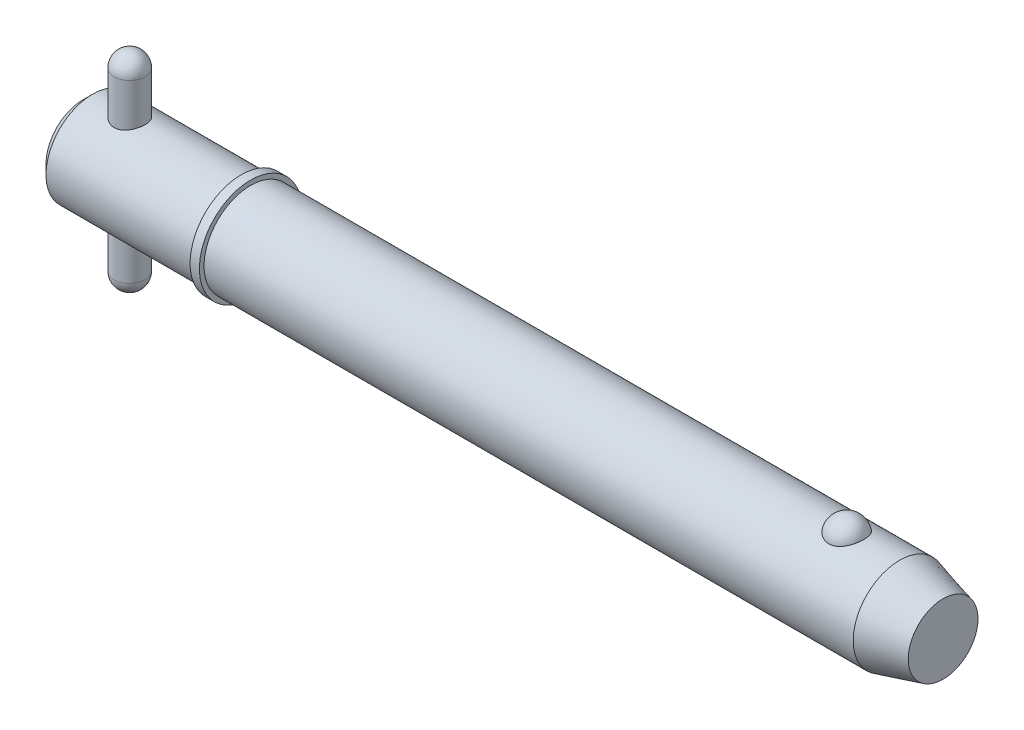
ISO-10303-21;
HEADER;
FILE_DESCRIPTION(('STEP AP214'),'2;1');
FILE_NAME('part.step','',(''),(''),'','','');
FILE_SCHEMA(('AUTOMOTIVE_DESIGN { 1 0 10303 214 1 1 1 1 }'));
ENDSEC;
DATA;
#1=APPLICATION_CONTEXT('core data for automotive mechanical design processes');
#2=APPLICATION_PROTOCOL_DEFINITION('international standard','automotive_design',2000,#1);
#3=PRODUCT_CONTEXT('',#1,'mechanical');
#4=PRODUCT('Part','Part','',(#3));
#5=PRODUCT_RELATED_PRODUCT_CATEGORY('part','',(#4));
#6=PRODUCT_DEFINITION_FORMATION('','',#4);
#7=PRODUCT_DEFINITION_CONTEXT('part definition',#1,'design');
#8=PRODUCT_DEFINITION('design','',#6,#7);
#9=PRODUCT_DEFINITION_SHAPE('','',#8);
#10=(LENGTH_UNIT() NAMED_UNIT(*) SI_UNIT(.MILLI.,.METRE.));
#11=(NAMED_UNIT(*) PLANE_ANGLE_UNIT() SI_UNIT($,.RADIAN.));
#12=(NAMED_UNIT(*) SI_UNIT($,.STERADIAN.) SOLID_ANGLE_UNIT());
#13=UNCERTAINTY_MEASURE_WITH_UNIT(LENGTH_MEASURE(1.E-05),#10,'distance_accuracy_value','');
#14=(GEOMETRIC_REPRESENTATION_CONTEXT(3) GLOBAL_UNCERTAINTY_ASSIGNED_CONTEXT((#13)) GLOBAL_UNIT_ASSIGNED_CONTEXT((#10,
#11,#12)) REPRESENTATION_CONTEXT('',''));
#15=CARTESIAN_POINT('',(0.,0.,0.));
#16=DIRECTION('',(0.,0.,1.));
#17=DIRECTION('',(1.,0.,0.));
#18=AXIS2_PLACEMENT_3D('',#15,#16,#17);
#19=CARTESIAN_POINT('',(7.14,15.875,0.));
#20=DIRECTION('',(0.,-1.,0.));
#21=DIRECTION('',(0.,0.,-1.));
#22=AXIS2_PLACEMENT_3D('',#19,#20,#21);
#23=CYLINDRICAL_SURFACE('',#22,2.38);
#24=CARTESIAN_POINT('',(7.14,-13.495,0.));
#25=DIRECTION('',(0.,-1.,0.));
#26=DIRECTION('',(0.,0.,-1.));
#27=AXIS2_PLACEMENT_3D('',#24,#25,#26);
#28=CIRCLE('',#27,2.38);
#29=CARTESIAN_POINT('',(7.14,-13.495,-2.38));
#30=VERTEX_POINT('',#29);
#31=EDGE_CURVE('P0_E10',#30,#30,#28,.F.);
#32=ORIENTED_EDGE('',*,*,#31,.T.);
#33=EDGE_LOOP('',(#32));
#34=FACE_BOUND('',#33,.T.);
#35=CARTESIAN_POINT('',(7.14,13.495,0.));
#36=DIRECTION('',(0.,-1.,0.));
#37=DIRECTION('',(0.,0.,-1.));
#38=AXIS2_PLACEMENT_3D('',#35,#36,#37);
#39=CIRCLE('',#38,2.38);
#40=CARTESIAN_POINT('',(7.14,13.495,-2.38));
#41=VERTEX_POINT('',#40);
#42=EDGE_CURVE('P0_E21',#41,#41,#39,.T.);
#43=ORIENTED_EDGE('',*,*,#42,.T.);
#44=EDGE_LOOP('',(#43));
#45=FACE_BOUND('',#44,.T.);
#46=ADVANCED_FACE('P0_F14',(#34,#45),#23,.T.);
#47=CARTESIAN_POINT('',(7.14,-13.495,0.));
#48=DIRECTION('',(0.,0.,1.));
#49=DIRECTION('',(1.,0.,0.));
#50=AXIS2_PLACEMENT_3D('',#47,#48,#49);
#51=SPHERICAL_SURFACE('',#50,2.38);
#52=CARTESIAN_POINT('',(7.14,-13.495,0.));
#53=DIRECTION('',(0.,-1.,0.));
#54=DIRECTION('',(0.,0.,-1.));
#55=AXIS2_PLACEMENT_3D('',#52,#53,#54);
#56=SPHERICAL_SURFACE('',#55,2.38);
#57=ORIENTED_EDGE('',*,*,#31,.F.);
#58=EDGE_LOOP('',(#57));
#59=FACE_BOUND('',#58,.T.);
#60=ADVANCED_FACE('P0_F29',(#59),#56,.T.);
#61=CARTESIAN_POINT('',(7.14,13.495,0.));
#62=DIRECTION('',(0.,0.,1.));
#63=DIRECTION('',(1.,0.,0.));
#64=AXIS2_PLACEMENT_3D('',#61,#62,#63);
#65=SPHERICAL_SURFACE('',#64,2.38);
#66=CARTESIAN_POINT('',(7.14,13.495,0.));
#67=DIRECTION('',(0.,-1.,0.));
#68=DIRECTION('',(0.,0.,-1.));
#69=AXIS2_PLACEMENT_3D('',#66,#67,#68);
#70=SPHERICAL_SURFACE('',#69,2.38);
#71=ORIENTED_EDGE('',*,*,#42,.F.);
#72=EDGE_LOOP('',(#71));
#73=FACE_BOUND('',#72,.T.);
#74=ADVANCED_FACE('P0_F16',(#73),#70,.T.);
#75=CLOSED_SHELL('',(#46,#60,#74));
#76=MANIFOLD_SOLID_BREP('P0_B1',#75);
#77=CARTESIAN_POINT('',(0.,0.,0.));
#78=DIRECTION('',(1.,0.,0.));
#79=DIRECTION('',(0.,0.,-1.));
#80=AXIS2_PLACEMENT_3D('',#77,#78,#79);
#81=CYLINDRICAL_SURFACE('',#80,7.145);
#82=CARTESIAN_POINT('',(125.38362424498,0.,0.));
#83=DIRECTION('',(1.,0.,0.));
#84=DIRECTION('',(0.,0.,-1.));
#85=AXIS2_PLACEMENT_3D('',#82,#83,#84);
#86=CIRCLE('',#85,7.145);
#87=CARTESIAN_POINT('',(125.38362424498,0.,-7.145));
#88=VERTEX_POINT('',#87);
#89=EDGE_CURVE('P1_E81',#88,#88,#86,.T.);
#90=ORIENTED_EDGE('',*,*,#89,.F.);
#91=EDGE_LOOP('',(#90));
#92=FACE_BOUND('',#91,.T.);
#93=CARTESIAN_POINT('',(25.7,0.,0.));
#94=DIRECTION('',(1.,0.,0.));
#95=DIRECTION('',(0.,0.,-1.));
#96=AXIS2_PLACEMENT_3D('',#93,#94,#95);
#97=CIRCLE('',#96,7.145);
#98=CARTESIAN_POINT('',(25.7,0.,-7.145));
#99=VERTEX_POINT('',#98);
#100=EDGE_CURVE('P1_E85',#99,#99,#97,.T.);
#101=ORIENTED_EDGE('',*,*,#100,.T.);
#102=EDGE_LOOP('',(#101));
#103=FACE_BOUND('',#102,.T.);
#104=CARTESIAN_POINT('',(117.239503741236,6.60328629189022,2.72903557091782));
#105=CARTESIAN_POINT('',(117.098315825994,6.60329644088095,2.72902496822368));
#106=CARTESIAN_POINT('',(116.956883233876,6.60799490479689,2.71772840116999));
#107=CARTESIAN_POINT('',(116.677955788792,6.62628236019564,2.67281935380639));
#108=CARTESIAN_POINT('',(116.540472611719,6.63989534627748,2.63914664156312));
#109=CARTESIAN_POINT('',(116.273889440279,6.67440775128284,2.55059642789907));
#110=CARTESIAN_POINT('',(116.144768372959,6.69528793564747,2.49577486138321));
#111=CARTESIAN_POINT('',(115.897869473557,6.74205585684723,2.36651799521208));
#112=CARTESIAN_POINT('',(115.780086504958,6.76794130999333,2.29209163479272));
#113=CARTESIAN_POINT('',(115.55516710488,6.82286177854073,2.12312937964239));
#114=CARTESIAN_POINT('',(115.448440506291,6.85196655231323,2.02807107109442));
#115=CARTESIAN_POINT('',(115.251918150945,6.90970232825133,1.82167822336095));
#116=CARTESIAN_POINT('',(115.162127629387,6.93833318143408,1.71033867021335));
#117=CARTESIAN_POINT('',(114.997667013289,6.9935167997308,1.46891951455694));
#118=CARTESIAN_POINT('',(114.923844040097,7.01992110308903,1.33822781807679));
#119=CARTESIAN_POINT('',(114.798088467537,7.06643385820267,1.0656656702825));
#120=CARTESIAN_POINT('',(114.74615735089,7.08654188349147,0.923794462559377));
#121=CARTESIAN_POINT('',(114.664732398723,7.11862399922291,0.630993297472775));
#122=CARTESIAN_POINT('',(114.635516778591,7.13049704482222,0.479974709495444));
#123=CARTESIAN_POINT('',(114.601174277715,7.14449484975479,0.174782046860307));
#124=CARTESIAN_POINT('',(114.596046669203,7.14661990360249,0.0206080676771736));
#125=CARTESIAN_POINT('',(114.609938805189,7.14092465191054,-0.285506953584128));
#126=CARTESIAN_POINT('',(114.628810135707,7.1331654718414,-0.437455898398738));
#127=CARTESIAN_POINT('',(114.690062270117,7.10859076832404,-0.73577860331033));
#128=CARTESIAN_POINT('',(114.732443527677,7.0917750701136,-0.882152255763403));
#129=CARTESIAN_POINT('',(114.839934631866,7.05076716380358,-1.16543149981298));
#130=CARTESIAN_POINT('',(114.905075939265,7.02656475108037,-1.30232366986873));
#131=CARTESIAN_POINT('',(115.056759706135,6.97329145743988,-1.56265907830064));
#132=CARTESIAN_POINT('',(115.143303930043,6.94422017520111,-1.68610120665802));
#133=CARTESIAN_POINT('',(115.336465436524,6.88415108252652,-1.91671004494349));
#134=CARTESIAN_POINT('',(115.443180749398,6.85314438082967,-2.02379244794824));
#135=CARTESIAN_POINT('',(115.673974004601,6.79282069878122,-2.21787433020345));
#136=CARTESIAN_POINT('',(115.798050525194,6.76350358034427,-2.30487545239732));
#137=CARTESIAN_POINT('',(116.057678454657,6.7106058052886,-2.45458647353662));
#138=CARTESIAN_POINT('',(116.192938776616,6.68691885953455,-2.5177624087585));
#139=CARTESIAN_POINT('',(116.473277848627,6.64741247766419,-2.62030218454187));
#140=CARTESIAN_POINT('',(116.618352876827,6.63159007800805,-2.65967499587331));
#141=CARTESIAN_POINT('',(116.906347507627,6.61038594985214,-2.71193301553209));
#142=CARTESIAN_POINT('',(117.04900807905,6.60451880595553,-2.72605165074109));
#143=CARTESIAN_POINT('',(117.33480047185,6.60240611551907,-2.73116688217));
#144=CARTESIAN_POINT('',(117.477932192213,6.60615862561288,-2.72216814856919));
#145=CARTESIAN_POINT('',(117.755848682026,6.6225609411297,-2.68200435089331));
#146=CARTESIAN_POINT('',(117.890754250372,6.63492533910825,-2.65154998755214));
#147=CARTESIAN_POINT('',(118.15332009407,6.66687445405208,-2.57015684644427));
#148=CARTESIAN_POINT('',(118.28097978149,6.68645975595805,-2.51921640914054));
#149=CARTESIAN_POINT('',(118.528577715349,6.73127274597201,-2.39693610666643));
#150=CARTESIAN_POINT('',(118.648287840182,6.7566138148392,-2.32517694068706));
#151=CARTESIAN_POINT('',(118.874159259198,6.8100600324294,-2.1636381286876));
#152=CARTESIAN_POINT('',(118.980317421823,6.83816581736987,-2.07385432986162));
#153=CARTESIAN_POINT('',(119.181862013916,6.89580469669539,-1.87357235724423));
#154=CARTESIAN_POINT('',(119.276440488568,6.92533863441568,-1.76226074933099));
#155=CARTESIAN_POINT('',(119.446332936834,6.98139526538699,-1.52511696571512));
#156=CARTESIAN_POINT('',(119.521643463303,7.0079174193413,-1.39928219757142));
#157=CARTESIAN_POINT('',(119.653595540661,7.05607625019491,-1.1321597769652));
#158=CARTESIAN_POINT('',(119.709568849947,7.07753119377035,-0.990508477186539));
#159=CARTESIAN_POINT('',(119.798296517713,7.11222355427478,-0.699154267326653));
#160=CARTESIAN_POINT('',(119.831050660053,7.12546089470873,-0.549451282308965));
#161=CARTESIAN_POINT('',(119.872689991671,7.1423758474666,-0.246120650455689));
#162=CARTESIAN_POINT('',(119.881558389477,7.14604673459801,-0.0924903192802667));
#163=CARTESIAN_POINT('',(119.875194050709,7.14343510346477,0.214181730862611));
#164=CARTESIAN_POINT('',(119.859961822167,7.13715279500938,0.367223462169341));
#165=CARTESIAN_POINT('',(119.805845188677,7.11532948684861,0.667595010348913));
#166=CARTESIAN_POINT('',(119.767077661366,7.09983424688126,0.814949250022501));
#167=CARTESIAN_POINT('',(119.666770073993,7.06119140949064,1.10063221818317));
#168=CARTESIAN_POINT('',(119.605228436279,7.03804328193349,1.23896032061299));
#169=CARTESIAN_POINT('',(119.460207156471,6.98632429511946,1.5035230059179));
#170=CARTESIAN_POINT('',(119.376606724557,6.95772382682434,1.62968561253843));
#171=CARTESIAN_POINT('',(119.18938046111,6.89823072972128,1.865543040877));
#172=CARTESIAN_POINT('',(119.085755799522,6.86733823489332,1.9752388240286));
#173=CARTESIAN_POINT('',(118.861076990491,6.80676456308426,2.17482293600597));
#174=CARTESIAN_POINT('',(118.740067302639,6.77708053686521,2.26476035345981));
#175=CARTESIAN_POINT('',(118.483340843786,6.7223050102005,2.42252989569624));
#176=CARTESIAN_POINT('',(118.34761851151,6.69721525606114,2.49035362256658));
#177=CARTESIAN_POINT('',(118.070402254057,6.65552591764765,2.59967646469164));
#178=CARTESIAN_POINT('',(117.929281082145,6.63865794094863,2.64202017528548));
#179=CARTESIAN_POINT('',(117.641444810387,6.61425039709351,2.70255841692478));
#180=CARTESIAN_POINT('',(117.494748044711,6.60668259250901,2.720826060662));
#181=CARTESIAN_POINT('',(117.311679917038,6.60358754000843,2.72830331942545));
#182=CARTESIAN_POINT('',(117.275599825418,6.60328369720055,2.72903828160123));
#183=CARTESIAN_POINT('',(117.239503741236,6.60328629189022,2.72903557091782));
#184=B_SPLINE_CURVE_WITH_KNOTS('',3,(#104,#105,#106,#107,#108,#109,#110,#111,#112,#113,#114,
#115,#116,#117,#118,#119,#120,#121,#122,#123,#124,#125,#126,#127,#128,#129,#130,#131,#132,#133,
#134,#135,#136,#137,#138,#139,#140,#141,#142,#143,#144,#145,#146,#147,#148,#149,#150,#151,#152,
#153,#154,#155,#156,#157,#158,#159,#160,#161,#162,#163,#164,#165,#166,#167,#168,#169,#170,#171,
#172,#173,#174,#175,#176,#177,#178,#179,#180,#181,#182,#183),.UNSPECIFIED.,.T.,.F.,(4,2,2,2,2,2,
2,2,2,2,2,2,2,2,2,2,2,2,2,2,2,2,2,2,2,2,2,2,2,2,2,2,2,2,2,2,2,2,2,4),(0.,0.423468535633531,
0.848081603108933,1.27157926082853,1.69488414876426,2.13051395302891,2.56627819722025,
3.0213670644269,3.47648674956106,3.93709649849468,4.39769233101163,4.85545355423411,
5.31322361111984,5.77162895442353,6.23007210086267,6.69080337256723,7.15149693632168,
7.60264329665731,8.05361952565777,8.48189729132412,8.91008854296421,9.32472524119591,
9.73939553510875,10.1630783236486,10.5868588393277,11.0319070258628,11.4770347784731,
11.9362874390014,12.3955443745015,12.855124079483,13.3146940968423,13.7720003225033,
14.2293382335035,14.6892343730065,15.1491036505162,15.6078171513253,16.0667046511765,
16.5093965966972,16.9507410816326,17.059004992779),.UNSPECIFIED.);
#185=CARTESIAN_POINT('',(117.239503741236,6.60328629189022,2.72903557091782));
#186=VERTEX_POINT('',#185);
#187=EDGE_CURVE('P1_E35',#186,#186,#184,.T.);
#188=ORIENTED_EDGE('',*,*,#187,.T.);
#189=EDGE_LOOP('',(#188));
#190=FACE_BOUND('',#189,.T.);
#191=ADVANCED_FACE('P1_F13',(#92,#103,#190),#81,.T.);
#192=CARTESIAN_POINT('',(0.,0.,0.));
#193=DIRECTION('',(-1.,0.,0.));
#194=DIRECTION('',(0.,0.,1.));
#195=AXIS2_PLACEMENT_3D('',#192,#193,#194);
#196=PLANE('',#195);
#197=CARTESIAN_POINT('',(0.,0.,0.));
#198=DIRECTION('',(1.,0.,0.));
#199=DIRECTION('',(0.,0.,-1.));
#200=AXIS2_PLACEMENT_3D('',#197,#198,#199);
#201=CIRCLE('',#200,5.716);
#202=CARTESIAN_POINT('',(0.,0.,-5.716));
#203=VERTEX_POINT('',#202);
#204=EDGE_CURVE('P1_E9',#203,#203,#201,.T.);
#205=ORIENTED_EDGE('',*,*,#204,.F.);
#206=EDGE_LOOP('',(#205));
#207=FACE_BOUND('',#206,.T.);
#208=ADVANCED_FACE('P1_F15',(#207),#196,.T.);
#209=CARTESIAN_POINT('',(1.42899999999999,0.,0.));
#210=DIRECTION('',(1.,0.,0.));
#211=DIRECTION('',(0.,0.,-1.));
#212=AXIS2_PLACEMENT_3D('',#209,#210,#211);
#213=CONICAL_SURFACE('',#212,7.145,0.78539816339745);
#214=ORIENTED_EDGE('',*,*,#204,.T.);
#215=EDGE_LOOP('',(#214));
#216=FACE_BOUND('',#215,.T.);
#217=CARTESIAN_POINT('',(1.42899999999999,0.,0.));
#218=DIRECTION('',(1.,0.,0.));
#219=DIRECTION('',(0.,0.,-1.));
#220=AXIS2_PLACEMENT_3D('',#217,#218,#219);
#221=CIRCLE('',#220,7.145);
#222=CARTESIAN_POINT('',(1.42899999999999,0.,-7.145));
#223=VERTEX_POINT('',#222);
#224=EDGE_CURVE('P1_E26',#223,#223,#221,.T.);
#225=ORIENTED_EDGE('',*,*,#224,.F.);
#226=EDGE_LOOP('',(#225));
#227=FACE_BOUND('',#226,.T.);
#228=ADVANCED_FACE('P1_F77',(#216,#227),#213,.T.);
#229=CARTESIAN_POINT('',(0.,0.,0.));
#230=DIRECTION('',(1.,0.,0.));
#231=DIRECTION('',(0.,0.,-1.));
#232=AXIS2_PLACEMENT_3D('',#229,#230,#231);
#233=CYLINDRICAL_SURFACE('',#232,7.145);
#234=CARTESIAN_POINT('',(7.14,-6.73695962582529,2.38));
#235=CARTESIAN_POINT('',(7.01035997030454,-6.73695921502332,2.38000059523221));
#236=CARTESIAN_POINT('',(6.88072348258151,-6.74074253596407,2.36937183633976));
#237=CARTESIAN_POINT('',(6.62529075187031,-6.75538853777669,2.32728080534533));
#238=CARTESIAN_POINT('',(6.49949514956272,-6.76625239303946,2.29581507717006));
#239=CARTESIAN_POINT('',(6.2554858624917,-6.79369535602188,2.21327763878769));
#240=CARTESIAN_POINT('',(6.13725786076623,-6.81026326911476,2.16224430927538));
#241=CARTESIAN_POINT('',(5.91100349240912,-6.84723128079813,2.04215132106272));
#242=CARTESIAN_POINT('',(5.80297937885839,-6.86763222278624,1.97308769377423));
#243=CARTESIAN_POINT('',(5.59597854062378,-6.91086152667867,1.81600414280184));
#244=CARTESIAN_POINT('',(5.49745861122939,-6.93375032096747,1.72739874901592));
#245=CARTESIAN_POINT('',(5.31636508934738,-6.97886546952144,1.53499636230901));
#246=CARTESIAN_POINT('',(5.23379405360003,-7.00109171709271,1.43119693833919));
#247=CARTESIAN_POINT('',(5.08487013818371,-7.04307708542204,1.20801318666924));
#248=CARTESIAN_POINT('',(5.01899578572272,-7.06275685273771,1.08829330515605));
#249=CARTESIAN_POINT('',(4.90850130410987,-7.09671988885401,0.838703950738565));
#250=CARTESIAN_POINT('',(4.86387545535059,-7.11100460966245,0.70883722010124));
#251=CARTESIAN_POINT('',(4.79869354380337,-7.13213998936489,0.44742990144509));
#252=CARTESIAN_POINT('',(4.77735497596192,-7.13923172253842,0.316104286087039));
#253=CARTESIAN_POINT('',(4.75686536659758,-7.14603777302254,0.0515578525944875));
#254=CARTESIAN_POINT('',(4.75770861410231,-7.14575398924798,-0.0816624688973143));
#255=CARTESIAN_POINT('',(4.78106216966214,-7.13800438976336,-0.340678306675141));
#256=CARTESIAN_POINT('',(4.80272255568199,-7.13082030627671,-0.466560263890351));
#257=CARTESIAN_POINT('',(4.86569013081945,-7.11043095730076,-0.712788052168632));
#258=CARTESIAN_POINT('',(4.90699865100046,-7.09722528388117,-0.833133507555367));
#259=CARTESIAN_POINT('',(5.00858673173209,-7.06591754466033,-1.06673173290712));
#260=CARTESIAN_POINT('',(5.06910834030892,-7.0477534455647,-1.17987058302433));
#261=CARTESIAN_POINT('',(5.20720514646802,-7.00841977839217,-1.39463797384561));
#262=CARTESIAN_POINT('',(5.28478508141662,-6.987249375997,-1.49626330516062));
#263=CARTESIAN_POINT('',(5.4590800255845,-6.94296010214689,-1.69017445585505));
#264=CARTESIAN_POINT('',(5.55652324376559,-6.91979641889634,-1.78179645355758));
#265=CARTESIAN_POINT('',(5.76558873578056,-6.87497076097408,-1.94761348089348));
#266=CARTESIAN_POINT('',(5.87721318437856,-6.85330901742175,-2.02180583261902));
#267=CARTESIAN_POINT('',(6.11357367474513,-6.81369485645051,-2.15157488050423));
#268=CARTESIAN_POINT('',(6.23847358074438,-6.79579956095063,-2.20687188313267));
#269=CARTESIAN_POINT('',(6.49655785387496,-6.76640630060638,-2.29542443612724));
#270=CARTESIAN_POINT('',(6.62973872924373,-6.75490565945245,-2.32868920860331));
#271=CARTESIAN_POINT('',(6.89417536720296,-6.74020933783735,-2.37088225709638));
#272=CARTESIAN_POINT('',(7.02524746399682,-6.73666278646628,-2.38083959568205));
#273=CARTESIAN_POINT('',(7.28721035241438,-6.73729555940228,-2.37904974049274));
#274=CARTESIAN_POINT('',(7.41810117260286,-6.7414734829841,-2.36730648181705));
#275=CARTESIAN_POINT('',(7.67130717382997,-6.75673471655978,-2.32337336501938));
#276=CARTESIAN_POINT('',(7.79376251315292,-6.76757635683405,-2.29189834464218));
#277=CARTESIAN_POINT('',(8.03162917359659,-6.79467771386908,-2.21025275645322));
#278=CARTESIAN_POINT('',(8.14703924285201,-6.8109383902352,-2.16007887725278));
#279=CARTESIAN_POINT('',(8.37159169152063,-6.84768362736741,-2.04065289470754));
#280=CARTESIAN_POINT('',(8.48041962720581,-6.86828569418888,-1.97084668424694));
#281=CARTESIAN_POINT('',(8.68518919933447,-6.91116416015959,-1.8147657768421));
#282=CARTESIAN_POINT('',(8.78112702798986,-6.93344105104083,-1.72848623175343));
#283=CARTESIAN_POINT('',(8.96215574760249,-6.97845348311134,-1.53698616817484));
#284=CARTESIAN_POINT('',(9.04650427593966,-7.00115965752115,-1.43105491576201));
#285=CARTESIAN_POINT('',(9.19627592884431,-7.04341676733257,-1.20598377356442));
#286=CARTESIAN_POINT('',(9.26169972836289,-7.06296781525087,-1.08684435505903));
#287=CARTESIAN_POINT('',(9.37116617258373,-7.0966205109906,-0.83933303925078));
#288=CARTESIAN_POINT('',(9.41534821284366,-7.11075755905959,-0.711027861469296));
#289=CARTESIAN_POINT('',(9.48132660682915,-7.13214194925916,-0.448245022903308));
#290=CARTESIAN_POINT('',(9.50313102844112,-7.13939177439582,-0.313769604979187));
#291=CARTESIAN_POINT('',(9.5230098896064,-7.14599771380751,-0.049254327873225));
#292=CARTESIAN_POINT('',(9.52215013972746,-7.14570837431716,0.0806974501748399));
#293=CARTESIAN_POINT('',(9.49935359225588,-7.13814116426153,0.338518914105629));
#294=CARTESIAN_POINT('',(9.47741850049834,-7.13086385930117,0.466388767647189));
#295=CARTESIAN_POINT('',(9.4138005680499,-7.11026814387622,0.714400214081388));
#296=CARTESIAN_POINT('',(9.37243609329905,-7.09704726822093,0.834632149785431));
#297=CARTESIAN_POINT('',(9.27142829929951,-7.06592602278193,1.06649582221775));
#298=CARTESIAN_POINT('',(9.2117816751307,-7.04802480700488,1.1781259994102));
#299=CARTESIAN_POINT('',(9.07336776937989,-7.00856499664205,1.39411030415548));
#300=CARTESIAN_POINT('',(8.99397590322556,-6.98689577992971,1.49804368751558));
#301=CARTESIAN_POINT('',(8.81938810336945,-6.9426110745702,1.69146078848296));
#302=CARTESIAN_POINT('',(8.72418713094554,-6.91999528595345,1.78093988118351));
#303=CARTESIAN_POINT('',(8.51623540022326,-6.87531507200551,1.94646188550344));
#304=CARTESIAN_POINT('',(8.4029442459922,-6.85330672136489,2.02184316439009));
#305=CARTESIAN_POINT('',(8.16461714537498,-6.81342065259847,2.1524427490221));
#306=CARTESIAN_POINT('',(8.03958429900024,-6.7955418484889,2.20766635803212));
#307=CARTESIAN_POINT('',(7.78712566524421,-6.76686117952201,2.29403636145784));
#308=CARTESIAN_POINT('',(7.66006989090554,-6.75577342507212,2.32616709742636));
#309=CARTESIAN_POINT('',(7.40200728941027,-6.74082409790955,2.36914495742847));
#310=CARTESIAN_POINT('',(7.27100183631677,-6.73696004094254,2.37999939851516));
#311=CARTESIAN_POINT('',(7.14,-6.73695962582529,2.38));
#312=B_SPLINE_CURVE_WITH_KNOTS('',3,(#234,#235,#236,#237,#238,#239,#240,#241,#242,#243,#244,
#245,#246,#247,#248,#249,#250,#251,#252,#253,#254,#255,#256,#257,#258,#259,#260,#261,#262,#263,
#264,#265,#266,#267,#268,#269,#270,#271,#272,#273,#274,#275,#276,#277,#278,#279,#280,#281,#282,
#283,#284,#285,#286,#287,#288,#289,#290,#291,#292,#293,#294,#295,#296,#297,#298,#299,#300,#301,
#302,#303,#304,#305,#306,#307,#308,#309,#310,#311),.UNSPECIFIED.,.T.,.F.,(4,2,2,2,2,2,2,2,2,2,2,
2,2,2,2,2,2,2,2,2,2,2,2,2,2,2,2,2,2,2,2,2,2,2,2,2,2,2,4),(0.,0.388434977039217,
0.776934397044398,1.16467566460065,1.55250234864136,1.9540847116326,2.35573139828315,
2.76784120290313,3.17984001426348,3.57752248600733,3.97510257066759,4.35711073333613,
4.7391447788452,5.12619663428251,5.51335611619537,5.91871976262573,6.3241456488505,
6.73533623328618,7.14635459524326,7.53885245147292,7.93127914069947,8.31025106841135,
8.68929014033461,9.08033871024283,9.47150254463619,9.88145528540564,10.2913934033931,
10.6986033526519,11.1056664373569,11.4936225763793,11.8815473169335,12.2633262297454,
12.645174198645,13.0411187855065,13.437189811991,13.8487371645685,14.2601761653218,
14.6528265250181,15.0453418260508),.UNSPECIFIED.);
#313=CARTESIAN_POINT('',(7.14,-6.73695962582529,2.38));
#314=VERTEX_POINT('',#313);
#315=EDGE_CURVE('P1_E17',#314,#314,#312,.T.);
#316=ORIENTED_EDGE('',*,*,#315,.F.);
#317=EDGE_LOOP('',(#316));
#318=FACE_BOUND('',#317,.T.);
#319=CARTESIAN_POINT('',(7.14,6.73695962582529,2.38));
#320=CARTESIAN_POINT('',(7.26964002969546,6.73695921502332,2.38000059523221));
#321=CARTESIAN_POINT('',(7.39927651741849,6.74074253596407,2.36937183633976));
#322=CARTESIAN_POINT('',(7.65470924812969,6.75538853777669,2.32728080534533));
#323=CARTESIAN_POINT('',(7.78050485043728,6.76625239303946,2.29581507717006));
#324=CARTESIAN_POINT('',(8.02451413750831,6.79369535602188,2.21327763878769));
#325=CARTESIAN_POINT('',(8.14274213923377,6.81026326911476,2.16224430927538));
#326=CARTESIAN_POINT('',(8.36899650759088,6.84723128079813,2.04215132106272));
#327=CARTESIAN_POINT('',(8.47702062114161,6.86763222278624,1.97308769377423));
#328=CARTESIAN_POINT('',(8.68402145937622,6.91086152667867,1.81600414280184));
#329=CARTESIAN_POINT('',(8.78254138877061,6.93375032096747,1.72739874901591));
#330=CARTESIAN_POINT('',(8.96363491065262,6.97886546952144,1.53499636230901));
#331=CARTESIAN_POINT('',(9.04620594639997,7.00109171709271,1.43119693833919));
#332=CARTESIAN_POINT('',(9.19512986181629,7.04307708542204,1.20801318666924));
#333=CARTESIAN_POINT('',(9.26100421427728,7.06275685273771,1.08829330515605));
#334=CARTESIAN_POINT('',(9.37149869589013,7.09671988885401,0.838703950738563));
#335=CARTESIAN_POINT('',(9.41612454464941,7.11100460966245,0.708837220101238));
#336=CARTESIAN_POINT('',(9.48130645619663,7.13213998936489,0.447429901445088));
#337=CARTESIAN_POINT('',(9.50264502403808,7.13923172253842,0.316104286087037));
#338=CARTESIAN_POINT('',(9.52313463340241,7.14603777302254,0.0515578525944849));
#339=CARTESIAN_POINT('',(9.52229138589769,7.14575398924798,-0.0816624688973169));
#340=CARTESIAN_POINT('',(9.49893783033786,7.13800438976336,-0.340678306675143));
#341=CARTESIAN_POINT('',(9.47727744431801,7.13082030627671,-0.466560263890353));
#342=CARTESIAN_POINT('',(9.41430986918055,7.11043095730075,-0.712788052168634));
#343=CARTESIAN_POINT('',(9.37300134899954,7.09722528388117,-0.833133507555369));
#344=CARTESIAN_POINT('',(9.27141326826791,7.06591754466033,-1.06673173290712));
#345=CARTESIAN_POINT('',(9.21089165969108,7.0477534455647,-1.17987058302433));
#346=CARTESIAN_POINT('',(9.07279485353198,7.00841977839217,-1.39463797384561));
#347=CARTESIAN_POINT('',(8.99521491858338,6.987249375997,-1.49626330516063));
#348=CARTESIAN_POINT('',(8.82091997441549,6.94296010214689,-1.69017445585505));
#349=CARTESIAN_POINT('',(8.72347675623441,6.91979641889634,-1.78179645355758));
#350=CARTESIAN_POINT('',(8.51441126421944,6.87497076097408,-1.94761348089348));
#351=CARTESIAN_POINT('',(8.40278681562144,6.85330901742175,-2.02180583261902));
#352=CARTESIAN_POINT('',(8.16642632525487,6.81369485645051,-2.15157488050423));
#353=CARTESIAN_POINT('',(8.04152641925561,6.79579956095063,-2.20687188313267));
#354=CARTESIAN_POINT('',(7.78344214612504,6.76640630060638,-2.29542443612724));
#355=CARTESIAN_POINT('',(7.65026127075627,6.75490565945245,-2.32868920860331));
#356=CARTESIAN_POINT('',(7.38582463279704,6.74020933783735,-2.37088225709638));
#357=CARTESIAN_POINT('',(7.25475253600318,6.73666278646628,-2.38083959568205));
#358=CARTESIAN_POINT('',(6.99278964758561,6.73729555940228,-2.37904974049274));
#359=CARTESIAN_POINT('',(6.86189882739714,6.7414734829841,-2.36730648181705));
#360=CARTESIAN_POINT('',(6.60869282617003,6.75673471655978,-2.32337336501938));
#361=CARTESIAN_POINT('',(6.48623748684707,6.76757635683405,-2.29189834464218));
#362=CARTESIAN_POINT('',(6.2483708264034,6.79467771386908,-2.21025275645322));
#363=CARTESIAN_POINT('',(6.13296075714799,6.8109383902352,-2.16007887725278));
#364=CARTESIAN_POINT('',(5.90840830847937,6.84768362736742,-2.04065289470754));
#365=CARTESIAN_POINT('',(5.79958037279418,6.86828569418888,-1.97084668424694));
#366=CARTESIAN_POINT('',(5.59481080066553,6.91116416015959,-1.8147657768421));
#367=CARTESIAN_POINT('',(5.49887297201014,6.93344105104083,-1.72848623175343));
#368=CARTESIAN_POINT('',(5.31784425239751,6.97845348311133,-1.53698616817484));
#369=CARTESIAN_POINT('',(5.23349572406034,7.00115965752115,-1.43105491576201));
#370=CARTESIAN_POINT('',(5.08372407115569,7.04341676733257,-1.20598377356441));
#371=CARTESIAN_POINT('',(5.01830027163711,7.06296781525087,-1.08684435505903));
#372=CARTESIAN_POINT('',(4.90883382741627,7.0966205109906,-0.839333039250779));
#373=CARTESIAN_POINT('',(4.86465178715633,7.11075755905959,-0.711027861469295));
#374=CARTESIAN_POINT('',(4.79867339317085,7.13214194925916,-0.448245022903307));
#375=CARTESIAN_POINT('',(4.77686897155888,7.13939177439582,-0.313769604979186));
#376=CARTESIAN_POINT('',(4.7569901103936,7.14599771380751,-0.0492543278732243));
#377=CARTESIAN_POINT('',(4.75784986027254,7.14570837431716,0.0806974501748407));
#378=CARTESIAN_POINT('',(4.78064640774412,7.13814116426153,0.33851891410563));
#379=CARTESIAN_POINT('',(4.80258149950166,7.13086385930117,0.46638876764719));
#380=CARTESIAN_POINT('',(4.8661994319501,7.11026814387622,0.714400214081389));
#381=CARTESIAN_POINT('',(4.90756390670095,7.09704726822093,0.834632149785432));
#382=CARTESIAN_POINT('',(5.00857170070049,7.06592602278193,1.06649582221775));
#383=CARTESIAN_POINT('',(5.0682183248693,7.04802480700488,1.1781259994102));
#384=CARTESIAN_POINT('',(5.20663223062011,7.00856499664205,1.39411030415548));
#385=CARTESIAN_POINT('',(5.28602409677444,6.98689577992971,1.49804368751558));
#386=CARTESIAN_POINT('',(5.46061189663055,6.9426110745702,1.69146078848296));
#387=CARTESIAN_POINT('',(5.55581286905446,6.91999528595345,1.78093988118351));
#388=CARTESIAN_POINT('',(5.76376459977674,6.87531507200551,1.94646188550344));
#389=CARTESIAN_POINT('',(5.8770557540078,6.85330672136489,2.02184316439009));
#390=CARTESIAN_POINT('',(6.11538285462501,6.81342065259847,2.1524427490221));
#391=CARTESIAN_POINT('',(6.24041570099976,6.7955418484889,2.20766635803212));
#392=CARTESIAN_POINT('',(6.4928743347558,6.76686117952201,2.29403636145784));
#393=CARTESIAN_POINT('',(6.61993010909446,6.75577342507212,2.32616709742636));
#394=CARTESIAN_POINT('',(6.87799271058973,6.74082409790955,2.36914495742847));
#395=CARTESIAN_POINT('',(7.00899816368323,6.73696004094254,2.37999939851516));
#396=CARTESIAN_POINT('',(7.14,6.73695962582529,2.38));
#397=B_SPLINE_CURVE_WITH_KNOTS('',3,(#319,#320,#321,#322,#323,#324,#325,#326,#327,#328,#329,
#330,#331,#332,#333,#334,#335,#336,#337,#338,#339,#340,#341,#342,#343,#344,#345,#346,#347,#348,
#349,#350,#351,#352,#353,#354,#355,#356,#357,#358,#359,#360,#361,#362,#363,#364,#365,#366,#367,
#368,#369,#370,#371,#372,#373,#374,#375,#376,#377,#378,#379,#380,#381,#382,#383,#384,#385,#386,
#387,#388,#389,#390,#391,#392,#393,#394,#395,#396),.UNSPECIFIED.,.T.,.F.,(4,2,2,2,2,2,2,2,2,2,2,
2,2,2,2,2,2,2,2,2,2,2,2,2,2,2,2,2,2,2,2,2,2,2,2,2,2,2,4),(0.,0.388434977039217,
0.776934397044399,1.16467566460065,1.55250234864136,1.9540847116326,2.35573139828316,
2.76784120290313,3.17984001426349,3.57752248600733,3.97510257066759,4.35711073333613,
4.73914477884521,5.12619663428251,5.51335611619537,5.91871976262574,6.3241456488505,
6.73533623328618,7.14635459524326,7.53885245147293,7.93127914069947,8.31025106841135,
8.68929014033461,9.08033871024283,9.47150254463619,9.88145528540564,10.2913934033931,
10.6986033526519,11.1056664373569,11.4936225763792,11.8815473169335,12.2633262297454,
12.645174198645,13.0411187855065,13.437189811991,13.8487371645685,14.2601761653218,
14.6528265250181,15.0453418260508),.UNSPECIFIED.);
#398=CARTESIAN_POINT('',(7.14,6.73695962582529,2.38));
#399=VERTEX_POINT('',#398);
#400=EDGE_CURVE('P1_E43',#399,#399,#397,.T.);
#401=ORIENTED_EDGE('',*,*,#400,.F.);
#402=EDGE_LOOP('',(#401));
#403=FACE_BOUND('',#402,.T.);
#404=ORIENTED_EDGE('',*,*,#224,.T.);
#405=EDGE_LOOP('',(#404));
#406=FACE_BOUND('',#405,.T.);
#407=CARTESIAN_POINT('',(24.271,0.,0.));
#408=DIRECTION('',(1.,0.,0.));
#409=DIRECTION('',(0.,0.,-1.));
#410=AXIS2_PLACEMENT_3D('',#407,#408,#409);
#411=CIRCLE('',#410,7.145);
#412=CARTESIAN_POINT('',(24.271,0.,-7.145));
#413=VERTEX_POINT('',#412);
#414=EDGE_CURVE('P1_E31',#413,#413,#411,.T.);
#415=ORIENTED_EDGE('',*,*,#414,.F.);
#416=EDGE_LOOP('',(#415));
#417=FACE_BOUND('',#416,.T.);
#418=ADVANCED_FACE('P1_F103',(#318,#403,#406,#417),#233,.T.);
#419=CARTESIAN_POINT('',(24.271,7.145,0.));
#420=DIRECTION('',(-1.,0.,0.));
#421=DIRECTION('',(0.,0.,1.));
#422=AXIS2_PLACEMENT_3D('',#419,#420,#421);
#423=PLANE('',#422);
#424=ORIENTED_EDGE('',*,*,#414,.T.);
#425=EDGE_LOOP('',(#424));
#426=FACE_BOUND('',#425,.T.);
#427=CARTESIAN_POINT('',(24.271,0.,0.));
#428=DIRECTION('',(1.,0.,0.));
#429=DIRECTION('',(0.,0.,-1.));
#430=AXIS2_PLACEMENT_3D('',#427,#428,#429);
#431=CIRCLE('',#430,7.8595);
#432=CARTESIAN_POINT('',(24.271,0.,-7.8595));
#433=VERTEX_POINT('',#432);
#434=EDGE_CURVE('P1_E91',#433,#433,#431,.T.);
#435=ORIENTED_EDGE('',*,*,#434,.F.);
#436=EDGE_LOOP('',(#435));
#437=FACE_BOUND('',#436,.T.);
#438=ADVANCED_FACE('P1_F100',(#426,#437),#423,.T.);
#439=CARTESIAN_POINT('',(0.,0.,0.));
#440=DIRECTION('',(1.,0.,0.));
#441=DIRECTION('',(0.,0.,-1.));
#442=AXIS2_PLACEMENT_3D('',#439,#440,#441);
#443=CYLINDRICAL_SURFACE('',#442,7.8595);
#444=ORIENTED_EDGE('',*,*,#434,.T.);
#445=EDGE_LOOP('',(#444));
#446=FACE_BOUND('',#445,.T.);
#447=CARTESIAN_POINT('',(25.7,0.,0.));
#448=DIRECTION('',(1.,0.,0.));
#449=DIRECTION('',(0.,0.,-1.));
#450=AXIS2_PLACEMENT_3D('',#447,#448,#449);
#451=CIRCLE('',#450,7.8595);
#452=CARTESIAN_POINT('',(25.7,0.,-7.8595));
#453=VERTEX_POINT('',#452);
#454=EDGE_CURVE('P1_E88',#453,#453,#451,.T.);
#455=ORIENTED_EDGE('',*,*,#454,.F.);
#456=EDGE_LOOP('',(#455));
#457=FACE_BOUND('',#456,.T.);
#458=ADVANCED_FACE('P1_F68',(#446,#457),#443,.T.);
#459=CARTESIAN_POINT('',(25.7,7.8595,0.));
#460=DIRECTION('',(1.,0.,0.));
#461=DIRECTION('',(0.,0.,-1.));
#462=AXIS2_PLACEMENT_3D('',#459,#460,#461);
#463=PLANE('',#462);
#464=ORIENTED_EDGE('',*,*,#454,.T.);
#465=EDGE_LOOP('',(#464));
#466=FACE_BOUND('',#465,.T.);
#467=ORIENTED_EDGE('',*,*,#100,.F.);
#468=EDGE_LOOP('',(#467));
#469=FACE_BOUND('',#468,.T.);
#470=ADVANCED_FACE('P1_F62',(#466,#469),#463,.T.);
#471=CARTESIAN_POINT('',(132.05,0.,0.));
#472=DIRECTION('',(-1.,0.,0.));
#473=DIRECTION('',(0.,0.,1.));
#474=AXIS2_PLACEMENT_3D('',#471,#472,#473);
#475=CONICAL_SURFACE('',#474,5.35875000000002,0.26179938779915);
#476=ORIENTED_EDGE('',*,*,#89,.T.);
#477=EDGE_LOOP('',(#476));
#478=FACE_BOUND('',#477,.T.);
#479=CARTESIAN_POINT('',(132.05,0.,0.));
#480=DIRECTION('',(1.,0.,0.));
#481=DIRECTION('',(0.,0.,-1.));
#482=AXIS2_PLACEMENT_3D('',#479,#480,#481);
#483=CIRCLE('',#482,5.35875000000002);
#484=CARTESIAN_POINT('',(132.05,0.,-5.35875000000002));
#485=VERTEX_POINT('',#484);
#486=EDGE_CURVE('P1_E42',#485,#485,#483,.T.);
#487=ORIENTED_EDGE('',*,*,#486,.F.);
#488=EDGE_LOOP('',(#487));
#489=FACE_BOUND('',#488,.T.);
#490=ADVANCED_FACE('P1_F59',(#478,#489),#475,.T.);
#491=CARTESIAN_POINT('',(132.05,5.35875000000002,0.));
#492=DIRECTION('',(1.,0.,0.));
#493=DIRECTION('',(0.,0.,-1.));
#494=AXIS2_PLACEMENT_3D('',#491,#492,#493);
#495=PLANE('',#494);
#496=ORIENTED_EDGE('',*,*,#486,.T.);
#497=EDGE_LOOP('',(#496));
#498=FACE_BOUND('',#497,.T.);
#499=ADVANCED_FACE('P1_F55',(#498),#495,.T.);
#500=CARTESIAN_POINT('',(117.239503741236,6.4305,0.));
#501=DIRECTION('',(-1.,0.,0.));
#502=DIRECTION('',(0.,-1.,0.));
#503=AXIS2_PLACEMENT_3D('',#500,#501,#502);
#504=SPHERICAL_SURFACE('',#503,2.73449999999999);
#505=ORIENTED_EDGE('',*,*,#187,.F.);
#506=EDGE_LOOP('',(#505));
#507=FACE_BOUND('',#506,.T.);
#508=ADVANCED_FACE('P1_F50',(#507),#504,.T.);
#509=CARTESIAN_POINT('',(7.14,-7.8595,0.));
#510=DIRECTION('',(0.,1.,0.));
#511=DIRECTION('',(0.,0.,1.));
#512=AXIS2_PLACEMENT_3D('',#509,#510,#511);
#513=CYLINDRICAL_SURFACE('',#512,2.38);
#514=ORIENTED_EDGE('',*,*,#315,.T.);
#515=EDGE_LOOP('',(#514));
#516=FACE_BOUND('',#515,.T.);
#517=ORIENTED_EDGE('',*,*,#400,.T.);
#518=EDGE_LOOP('',(#517));
#519=FACE_BOUND('',#518,.T.);
#520=ADVANCED_FACE('P1_F54',(#516,#519),#513,.F.);
#521=CLOSED_SHELL('',(#191,#208,#228,#418,#438,#458,#470,#490,#499,#508,#520));
#522=MANIFOLD_SOLID_BREP('P1_B1',#521);
#523=ADVANCED_BREP_SHAPE_REPRESENTATION('',(#18,#76,#522),#14);
#524=SHAPE_DEFINITION_REPRESENTATION(#9,#523);
ENDSEC;
END-ISO-10303-21;
